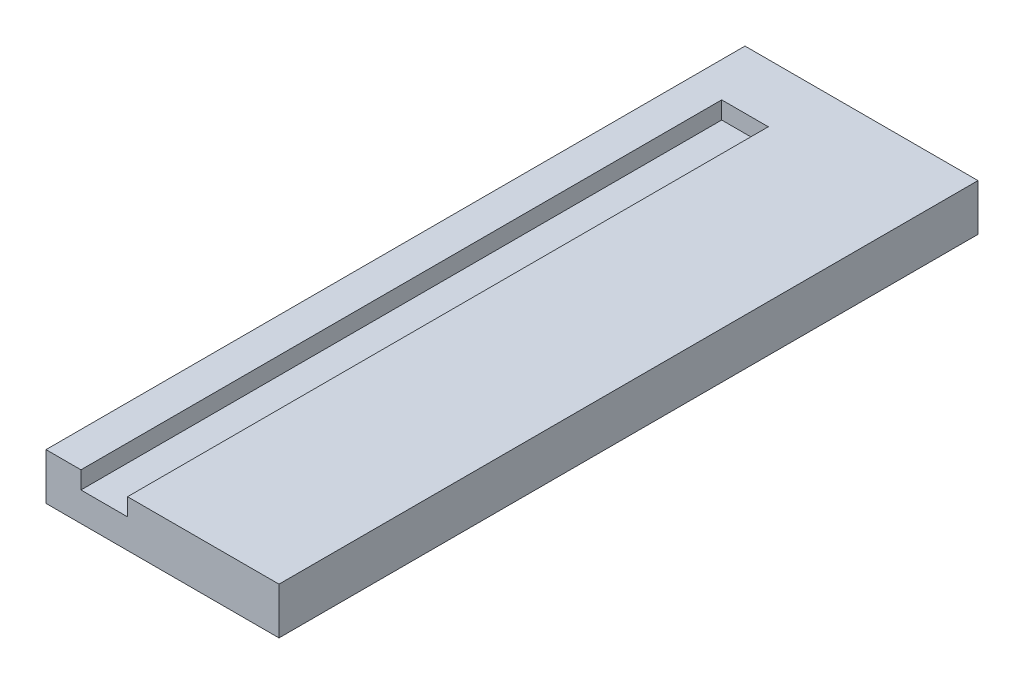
ISO-10303-21;
HEADER;
FILE_DESCRIPTION(('STEP AP214'),'2;1');
FILE_NAME('part.step','',(''),(''),'','','');
FILE_SCHEMA(('AUTOMOTIVE_DESIGN { 1 0 10303 214 1 1 1 1 }'));
ENDSEC;
DATA;
#1=APPLICATION_CONTEXT('core data for automotive mechanical design processes');
#2=APPLICATION_PROTOCOL_DEFINITION('international standard','automotive_design',2000,#1);
#3=PRODUCT_CONTEXT('',#1,'mechanical');
#4=PRODUCT('Part','Part','',(#3));
#5=PRODUCT_RELATED_PRODUCT_CATEGORY('part','',(#4));
#6=PRODUCT_DEFINITION_FORMATION('','',#4);
#7=PRODUCT_DEFINITION_CONTEXT('part definition',#1,'design');
#8=PRODUCT_DEFINITION('design','',#6,#7);
#9=PRODUCT_DEFINITION_SHAPE('','',#8);
#10=(LENGTH_UNIT() NAMED_UNIT(*) SI_UNIT(.MILLI.,.METRE.));
#11=(NAMED_UNIT(*) PLANE_ANGLE_UNIT() SI_UNIT($,.RADIAN.));
#12=(NAMED_UNIT(*) SI_UNIT($,.STERADIAN.) SOLID_ANGLE_UNIT());
#13=UNCERTAINTY_MEASURE_WITH_UNIT(LENGTH_MEASURE(1.E-05),#10,'distance_accuracy_value','');
#14=(GEOMETRIC_REPRESENTATION_CONTEXT(3) GLOBAL_UNCERTAINTY_ASSIGNED_CONTEXT((#13)) GLOBAL_UNIT_ASSIGNED_CONTEXT((#10,
#11,#12)) REPRESENTATION_CONTEXT('',''));
#15=CARTESIAN_POINT('',(0.,0.,0.));
#16=DIRECTION('',(0.,0.,1.));
#17=DIRECTION('',(1.,0.,0.));
#18=AXIS2_PLACEMENT_3D('',#15,#16,#17);
#19=CARTESIAN_POINT('',(0.,0.,-600.));
#20=DIRECTION('',(-1.,0.,0.));
#21=DIRECTION('',(0.,-1.,0.));
#22=AXIS2_PLACEMENT_3D('',#19,#20,#21);
#23=PLANE('',#22);
#24=DIRECTION('',(0.,-1.,0.));
#25=VECTOR('',#24,1.);
#26=CARTESIAN_POINT('',(0.,0.,0.));
#27=LINE('',#26,#25);
#28=CARTESIAN_POINT('',(0.,0.,0.));
#29=VERTEX_POINT('',#28);
#30=CARTESIAN_POINT('',(0.,-40.,0.));
#31=VERTEX_POINT('',#30);
#32=EDGE_CURVE('E138',#29,#31,#27,.T.);
#33=ORIENTED_EDGE('',*,*,#32,.F.);
#34=DIRECTION('',(0.,0.,1.));
#35=VECTOR('',#34,1.);
#36=CARTESIAN_POINT('',(0.,0.,-600.));
#37=LINE('',#36,#35);
#38=CARTESIAN_POINT('',(0.,0.,-600.));
#39=VERTEX_POINT('',#38);
#40=EDGE_CURVE('E11',#39,#29,#37,.T.);
#41=ORIENTED_EDGE('',*,*,#40,.F.);
#42=DIRECTION('',(0.,-1.,0.));
#43=VECTOR('',#42,1.);
#44=CARTESIAN_POINT('',(0.,0.,-600.));
#45=LINE('',#44,#43);
#46=CARTESIAN_POINT('',(0.,-40.,-600.));
#47=VERTEX_POINT('',#46);
#48=EDGE_CURVE('E143',#39,#47,#45,.T.);
#49=ORIENTED_EDGE('',*,*,#48,.T.);
#50=DIRECTION('',(0.,0.,1.));
#51=VECTOR('',#50,1.);
#52=CARTESIAN_POINT('',(0.,-40.,-600.));
#53=LINE('',#52,#51);
#54=EDGE_CURVE('E36',#47,#31,#53,.T.);
#55=ORIENTED_EDGE('',*,*,#54,.T.);
#56=EDGE_LOOP('',(#33,#41,#49,#55));
#57=FACE_BOUND('',#56,.T.);
#58=ADVANCED_FACE('F33',(#57),#23,.T.);
#59=CARTESIAN_POINT('',(0.,0.,-600.));
#60=DIRECTION('',(0.,1.,0.));
#61=DIRECTION('',(0.,0.,1.));
#62=AXIS2_PLACEMENT_3D('',#59,#60,#61);
#63=PLANE('',#62);
#64=DIRECTION('',(0.,0.,1.));
#65=VECTOR('',#64,1.);
#66=CARTESIAN_POINT('',(30.,0.,-550.));
#67=LINE('',#66,#65);
#68=CARTESIAN_POINT('',(30.,0.,-550.));
#69=VERTEX_POINT('',#68);
#70=CARTESIAN_POINT('',(30.,0.,0.));
#71=VERTEX_POINT('',#70);
#72=EDGE_CURVE('E136',#69,#71,#67,.T.);
#73=ORIENTED_EDGE('',*,*,#72,.F.);
#74=DIRECTION('',(-1.,0.,0.));
#75=VECTOR('',#74,1.);
#76=CARTESIAN_POINT('',(30.,0.,-550.));
#77=LINE('',#76,#75);
#78=CARTESIAN_POINT('',(70.,0.,-550.));
#79=VERTEX_POINT('',#78);
#80=EDGE_CURVE('E114',#79,#69,#77,.T.);
#81=ORIENTED_EDGE('',*,*,#80,.F.);
#82=DIRECTION('',(0.,0.,1.));
#83=VECTOR('',#82,1.);
#84=CARTESIAN_POINT('',(70.,0.,-550.));
#85=LINE('',#84,#83);
#86=CARTESIAN_POINT('',(70.,0.,0.));
#87=VERTEX_POINT('',#86);
#88=EDGE_CURVE('E139',#79,#87,#85,.T.);
#89=ORIENTED_EDGE('',*,*,#88,.T.);
#90=DIRECTION('',(-1.,0.,0.));
#91=VECTOR('',#90,1.);
#92=CARTESIAN_POINT('',(0.,0.,0.));
#93=LINE('',#92,#91);
#94=CARTESIAN_POINT('',(200.,0.,0.));
#95=VERTEX_POINT('',#94);
#96=EDGE_CURVE('E146',#95,#87,#93,.T.);
#97=ORIENTED_EDGE('',*,*,#96,.F.);
#98=DIRECTION('',(0.,0.,1.));
#99=VECTOR('',#98,1.);
#100=CARTESIAN_POINT('',(200.,0.,-600.));
#101=LINE('',#100,#99);
#102=CARTESIAN_POINT('',(200.,0.,-600.));
#103=VERTEX_POINT('',#102);
#104=EDGE_CURVE('E41',#103,#95,#101,.T.);
#105=ORIENTED_EDGE('',*,*,#104,.F.);
#106=DIRECTION('',(-1.,0.,0.));
#107=VECTOR('',#106,1.);
#108=CARTESIAN_POINT('',(0.,0.,-600.));
#109=LINE('',#108,#107);
#110=EDGE_CURVE('E151',#103,#39,#109,.T.);
#111=ORIENTED_EDGE('',*,*,#110,.T.);
#112=ORIENTED_EDGE('',*,*,#40,.T.);
#113=EDGE_CURVE('E78',#71,#29,#93,.T.);
#114=ORIENTED_EDGE('',*,*,#113,.F.);
#115=EDGE_LOOP('',(#73,#81,#89,#97,#105,#111,#112,#114));
#116=FACE_BOUND('',#115,.T.);
#117=ADVANCED_FACE('F180',(#116),#63,.T.);
#118=CARTESIAN_POINT('',(200.,0.,-600.));
#119=DIRECTION('',(1.,0.,0.));
#120=DIRECTION('',(0.,0.,-1.));
#121=AXIS2_PLACEMENT_3D('',#118,#119,#120);
#122=PLANE('',#121);
#123=DIRECTION('',(0.,1.,0.));
#124=VECTOR('',#123,1.);
#125=CARTESIAN_POINT('',(200.,0.,0.));
#126=LINE('',#125,#124);
#127=CARTESIAN_POINT('',(200.,-40.,0.));
#128=VERTEX_POINT('',#127);
#129=EDGE_CURVE('E158',#128,#95,#126,.T.);
#130=ORIENTED_EDGE('',*,*,#129,.F.);
#131=DIRECTION('',(0.,0.,1.));
#132=VECTOR('',#131,1.);
#133=CARTESIAN_POINT('',(200.,-40.,-600.));
#134=LINE('',#133,#132);
#135=CARTESIAN_POINT('',(200.,-40.,-600.));
#136=VERTEX_POINT('',#135);
#137=EDGE_CURVE('E163',#136,#128,#134,.T.);
#138=ORIENTED_EDGE('',*,*,#137,.F.);
#139=DIRECTION('',(0.,1.,0.));
#140=VECTOR('',#139,1.);
#141=CARTESIAN_POINT('',(200.,0.,-600.));
#142=LINE('',#141,#140);
#143=EDGE_CURVE('E148',#136,#103,#142,.T.);
#144=ORIENTED_EDGE('',*,*,#143,.T.);
#145=ORIENTED_EDGE('',*,*,#104,.T.);
#146=EDGE_LOOP('',(#130,#138,#144,#145));
#147=FACE_BOUND('',#146,.T.);
#148=ADVANCED_FACE('F184',(#147),#122,.T.);
#149=CARTESIAN_POINT('',(0.,-40.,-600.));
#150=DIRECTION('',(0.,-1.,0.));
#151=DIRECTION('',(0.,0.,-1.));
#152=AXIS2_PLACEMENT_3D('',#149,#150,#151);
#153=PLANE('',#152);
#154=DIRECTION('',(1.,0.,0.));
#155=VECTOR('',#154,1.);
#156=CARTESIAN_POINT('',(0.,-40.,0.));
#157=LINE('',#156,#155);
#158=EDGE_CURVE('E155',#31,#128,#157,.T.);
#159=ORIENTED_EDGE('',*,*,#158,.F.);
#160=ORIENTED_EDGE('',*,*,#54,.F.);
#161=DIRECTION('',(1.,0.,0.));
#162=VECTOR('',#161,1.);
#163=CARTESIAN_POINT('',(0.,-40.,-600.));
#164=LINE('',#163,#162);
#165=EDGE_CURVE('E145',#47,#136,#164,.T.);
#166=ORIENTED_EDGE('',*,*,#165,.T.);
#167=ORIENTED_EDGE('',*,*,#137,.T.);
#168=EDGE_LOOP('',(#159,#160,#166,#167));
#169=FACE_BOUND('',#168,.T.);
#170=ADVANCED_FACE('F165',(#169),#153,.T.);
#171=CARTESIAN_POINT('',(0.,0.,-600.));
#172=DIRECTION('',(0.,0.,1.));
#173=DIRECTION('',(1.,0.,0.));
#174=AXIS2_PLACEMENT_3D('',#171,#172,#173);
#175=PLANE('',#174);
#176=ORIENTED_EDGE('',*,*,#48,.F.);
#177=ORIENTED_EDGE('',*,*,#110,.F.);
#178=ORIENTED_EDGE('',*,*,#143,.F.);
#179=ORIENTED_EDGE('',*,*,#165,.F.);
#180=EDGE_LOOP('',(#176,#177,#178,#179));
#181=FACE_BOUND('',#180,.T.);
#182=ADVANCED_FACE('F168',(#181),#175,.F.);
#183=CARTESIAN_POINT('',(0.,0.,0.));
#184=DIRECTION('',(0.,0.,1.));
#185=DIRECTION('',(1.,0.,0.));
#186=AXIS2_PLACEMENT_3D('',#183,#184,#185);
#187=PLANE('',#186);
#188=DIRECTION('',(0.,-1.,0.));
#189=VECTOR('',#188,1.);
#190=CARTESIAN_POINT('',(30.,-15.,0.));
#191=LINE('',#190,#189);
#192=CARTESIAN_POINT('',(30.,-15.,0.));
#193=VERTEX_POINT('',#192);
#194=EDGE_CURVE('E49',#71,#193,#191,.T.);
#195=ORIENTED_EDGE('',*,*,#194,.F.);
#196=ORIENTED_EDGE('',*,*,#113,.T.);
#197=ORIENTED_EDGE('',*,*,#32,.T.);
#198=ORIENTED_EDGE('',*,*,#158,.T.);
#199=ORIENTED_EDGE('',*,*,#129,.T.);
#200=ORIENTED_EDGE('',*,*,#96,.T.);
#201=DIRECTION('',(0.,1.,0.));
#202=VECTOR('',#201,1.);
#203=CARTESIAN_POINT('',(70.,0.,0.));
#204=LINE('',#203,#202);
#205=CARTESIAN_POINT('',(70.,-15.,0.));
#206=VERTEX_POINT('',#205);
#207=EDGE_CURVE('E127',#206,#87,#204,.T.);
#208=ORIENTED_EDGE('',*,*,#207,.F.);
#209=DIRECTION('',(1.,0.,0.));
#210=VECTOR('',#209,1.);
#211=CARTESIAN_POINT('',(70.,-15.,0.));
#212=LINE('',#211,#210);
#213=EDGE_CURVE('E129',#193,#206,#212,.T.);
#214=ORIENTED_EDGE('',*,*,#213,.F.);
#215=EDGE_LOOP('',(#195,#196,#197,#198,#199,#200,#208,#214));
#216=FACE_BOUND('',#215,.T.);
#217=ADVANCED_FACE('F166',(#216),#187,.T.);
#218=CARTESIAN_POINT('',(30.,-15.,-550.));
#219=DIRECTION('',(-1.,0.,0.));
#220=DIRECTION('',(0.,0.,1.));
#221=AXIS2_PLACEMENT_3D('',#218,#219,#220);
#222=PLANE('',#221);
#223=ORIENTED_EDGE('',*,*,#194,.T.);
#224=DIRECTION('',(0.,0.,1.));
#225=VECTOR('',#224,1.);
#226=CARTESIAN_POINT('',(30.,-15.,-550.));
#227=LINE('',#226,#225);
#228=CARTESIAN_POINT('',(30.,-15.,-550.));
#229=VERTEX_POINT('',#228);
#230=EDGE_CURVE('E104',#229,#193,#227,.T.);
#231=ORIENTED_EDGE('',*,*,#230,.F.);
#232=DIRECTION('',(0.,-1.,0.));
#233=VECTOR('',#232,1.);
#234=CARTESIAN_POINT('',(30.,-15.,-550.));
#235=LINE('',#234,#233);
#236=EDGE_CURVE('E108',#69,#229,#235,.T.);
#237=ORIENTED_EDGE('',*,*,#236,.F.);
#238=ORIENTED_EDGE('',*,*,#72,.T.);
#239=EDGE_LOOP('',(#223,#231,#237,#238));
#240=FACE_BOUND('',#239,.T.);
#241=ADVANCED_FACE('F106',(#240),#222,.F.);
#242=CARTESIAN_POINT('',(70.,0.,-550.));
#243=DIRECTION('',(1.,0.,0.));
#244=DIRECTION('',(0.,0.,-1.));
#245=AXIS2_PLACEMENT_3D('',#242,#243,#244);
#246=PLANE('',#245);
#247=ORIENTED_EDGE('',*,*,#207,.T.);
#248=ORIENTED_EDGE('',*,*,#88,.F.);
#249=DIRECTION('',(0.,1.,0.));
#250=VECTOR('',#249,1.);
#251=CARTESIAN_POINT('',(70.,0.,-550.));
#252=LINE('',#251,#250);
#253=CARTESIAN_POINT('',(70.,-15.,-550.));
#254=VERTEX_POINT('',#253);
#255=EDGE_CURVE('E122',#254,#79,#252,.T.);
#256=ORIENTED_EDGE('',*,*,#255,.F.);
#257=DIRECTION('',(0.,0.,1.));
#258=VECTOR('',#257,1.);
#259=CARTESIAN_POINT('',(70.,-15.,-550.));
#260=LINE('',#259,#258);
#261=EDGE_CURVE('E113',#254,#206,#260,.T.);
#262=ORIENTED_EDGE('',*,*,#261,.T.);
#263=EDGE_LOOP('',(#247,#248,#256,#262));
#264=FACE_BOUND('',#263,.T.);
#265=ADVANCED_FACE('F174',(#264),#246,.F.);
#266=CARTESIAN_POINT('',(70.,-15.,-550.));
#267=DIRECTION('',(0.,-1.,0.));
#268=DIRECTION('',(1.,0.,0.));
#269=AXIS2_PLACEMENT_3D('',#266,#267,#268);
#270=PLANE('',#269);
#271=ORIENTED_EDGE('',*,*,#213,.T.);
#272=ORIENTED_EDGE('',*,*,#261,.F.);
#273=DIRECTION('',(1.,0.,0.));
#274=VECTOR('',#273,1.);
#275=CARTESIAN_POINT('',(70.,-15.,-550.));
#276=LINE('',#275,#274);
#277=EDGE_CURVE('E117',#229,#254,#276,.T.);
#278=ORIENTED_EDGE('',*,*,#277,.F.);
#279=ORIENTED_EDGE('',*,*,#230,.T.);
#280=EDGE_LOOP('',(#271,#272,#278,#279));
#281=FACE_BOUND('',#280,.T.);
#282=ADVANCED_FACE('F118',(#281),#270,.F.);
#283=CARTESIAN_POINT('',(0.,0.,-550.));
#284=DIRECTION('',(0.,0.,-1.));
#285=DIRECTION('',(-1.,0.,0.));
#286=AXIS2_PLACEMENT_3D('',#283,#284,#285);
#287=PLANE('',#286);
#288=ORIENTED_EDGE('',*,*,#236,.T.);
#289=ORIENTED_EDGE('',*,*,#277,.T.);
#290=ORIENTED_EDGE('',*,*,#255,.T.);
#291=ORIENTED_EDGE('',*,*,#80,.T.);
#292=EDGE_LOOP('',(#288,#289,#290,#291));
#293=FACE_BOUND('',#292,.T.);
#294=ADVANCED_FACE('F124',(#293),#287,.F.);
#295=CLOSED_SHELL('',(#58,#117,#148,#170,#182,#217,#241,#265,#282,#294));
#296=MANIFOLD_SOLID_BREP('B2',#295);
#297=ADVANCED_BREP_SHAPE_REPRESENTATION('',(#18,#296),#14);
#298=SHAPE_DEFINITION_REPRESENTATION(#9,#297);
ENDSEC;
END-ISO-10303-21;
